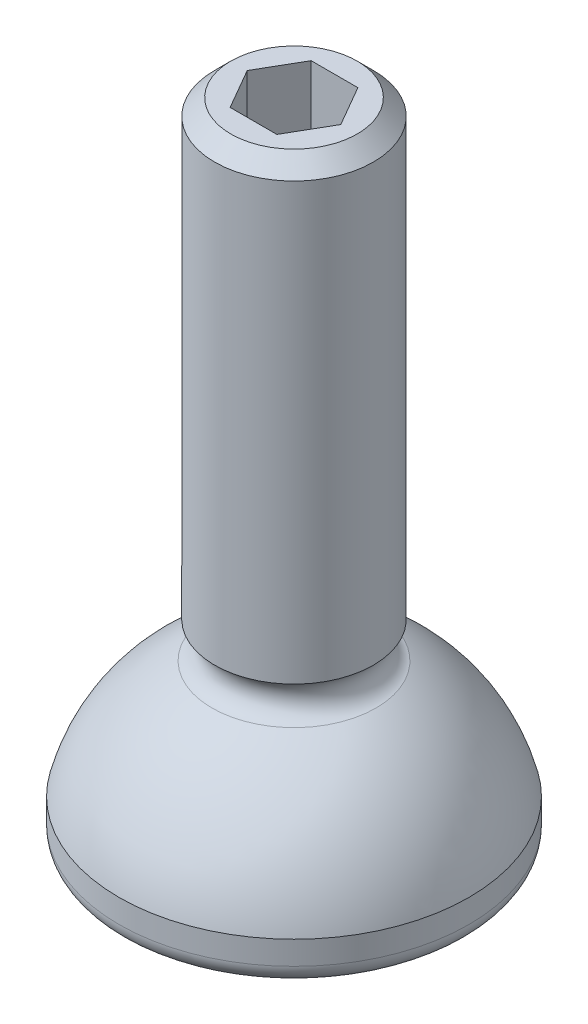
from build123d import *

# Parameters (mm, degrees)
CHAMFER1_SIZE         = 0.635
FILLET1_R             = 0.762
HOLE1_D               = 3.175
HOLE1_DEPTH           = 4.826
HOLE1_TIP             = 0.953866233
HOLE1_ON_FACE_2_D     = 3.175
HOLE1_ON_FACE_2_DEPTH = 4.826
HOLE1_ON_FACE_2_TIP   = 0.953866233
CUT_EXTRUDE1_DEPTH    = 3.302
SKETCH5_R             = 0.762


with BuildPart() as part:
    # Sketch1 → Revolve1 (revolve)
    with BuildSketch(Plane.XY):
        with BuildLine():
            Line((0, 0), (6.858, 0))
            Line((6.858, 0), (6.858, 1.681779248))
            ThreePointArc((6.858, 1.681779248), (5.501768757, 4.426181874), (3.1115, 6.338699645))
            Line((3.1115, 6.338699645), (3.1115, 25.4))
            Line((3.1115, 25.4), (0, 25.4))
            Line((0, 25.4), (0, 0))
        make_face()
    revolve(axis=Axis((0, -1000, 0), (0, 1, 0)))

    # Chamfer1
    chamfer1_edges = [part.edges().sort_by_distance(p)[0] for p in [
        (-3.1115, 25.4, 0),
    ]]
    chamfer(chamfer1_edges, length=CHAMFER1_SIZE)

    # Fillet1
    fillet1_edges = [part.edges().sort_by_distance(p)[0] for p in [
        (-6.858, 0, 0),
    ]]
    fillet(fillet1_edges, radius=FILLET1_R)

    # Hole1
    with Locations(Plane(origin=(0, 25.4, 0), x_dir=(1, 0, 0), z_dir=(0, 1, 0))):
        with Locations((0, 0)):
            Hole(HOLE1_D / 2, depth=HOLE1_DEPTH)
            with Locations((0, 0, -(HOLE1_DEPTH + HOLE1_TIP / 2))):  # 118° drill point
                Cone(0, HOLE1_D / 2, HOLE1_TIP, mode=Mode.SUBTRACT)

    # Hole1 on face 2
    with Locations(Plane(origin=(17.71717461, 0, -13.159625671), x_dir=(1, 0, 0), z_dir=(0, 1, 0))):
        with Locations((0, 0)):
            Hole(HOLE1_ON_FACE_2_D / 2, depth=HOLE1_ON_FACE_2_DEPTH)
            with Locations((0, 0, -(HOLE1_ON_FACE_2_DEPTH + HOLE1_ON_FACE_2_TIP / 2))):  # 118° drill point
                Cone(0, HOLE1_ON_FACE_2_D / 2, HOLE1_ON_FACE_2_TIP, mode=Mode.SUBTRACT)

    # Sketch4 → Cut-Extrude1 (cut)
    with BuildSketch(Plane(origin=(0, 25.4, 0), x_dir=(1, 0, 0), z_dir=(0, 1, 0))):
        Polygon((0.916543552, 1.5875), (-0.916543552, 1.5875), (-1.833087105, 0), (-0.916543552, -1.5875), (0.916543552, -1.5875), (1.833087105, 0), align=None)
    extrude(amount=-CUT_EXTRUDE1_DEPTH, mode=Mode.SUBTRACT)

    # Sketch5 → Cut-Revolve1 (revolve, cut)
    with BuildSketch(Plane.XY):
        with Locations((3.4544, 7.0104)):
            Circle(SKETCH5_R)
    revolve(axis=Axis((0, -1000, 0), (0, 1, 0)), mode=Mode.SUBTRACT)


solid = part.part
